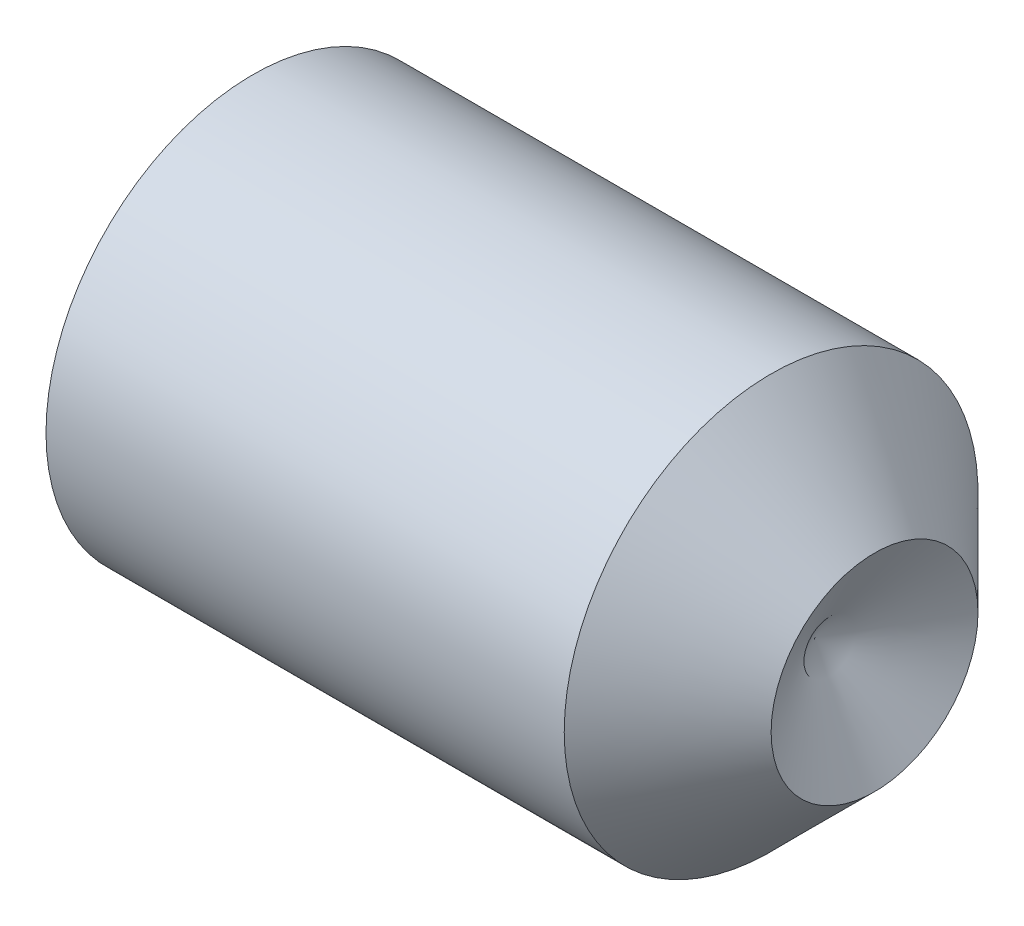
from build123d import *

# Parameters (mm, degrees)
HEX_2_DEPTH = 3


with BuildPart() as part:
    # BodySke → BaseBody (revolve)
    with BuildSketch(Plane.XY, mode=Mode.PRIVATE) as basebody_sk:
        Polygon((0, 0), (0, 1.655), (0.487860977, 2.5), (6.75, 2.5), (8, 1.25), (7.278312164, 0), align=None)
    revolve(basebody_sk.sketch.rotate(Axis((-12.7, 0, 0), (1, 0, 0)), 90), axis=Axis((-12.7, 0, 0), (1, 0, 0)))

    # Sketch2 → Hex 2 (cut)
    with BuildSketch(Plane.ZY):
        Polygon((0.721687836, 1.25), (-0.721687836, 1.25), (-1.443375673, 0), (-0.721687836, -1.25), (0.721687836, -1.25), (1.443375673, 0), align=None)
    extrude(amount=-HEX_2_DEPTH, mode=Mode.SUBTRACT)


solid = part.part
